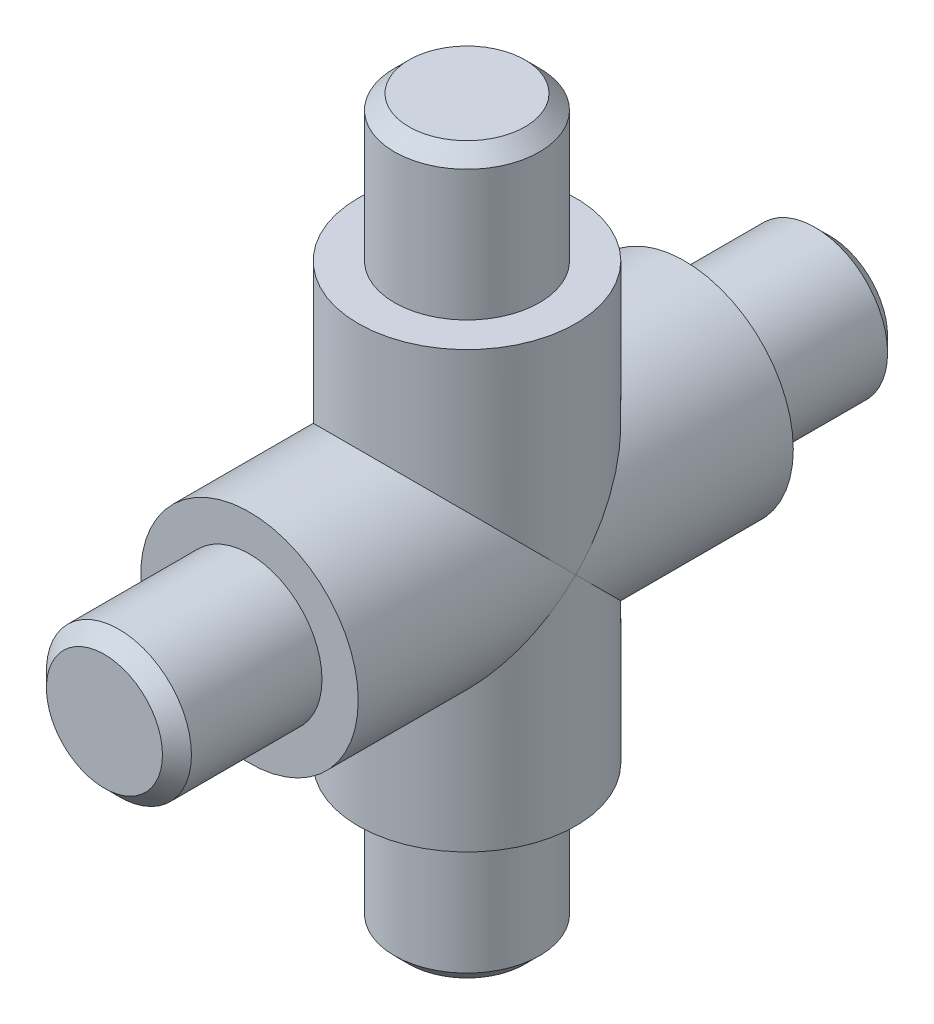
ISO-10303-21;
HEADER;
FILE_DESCRIPTION(('STEP AP214'),'2;1');
FILE_NAME('part.step','',(''),(''),'','','');
FILE_SCHEMA(('AUTOMOTIVE_DESIGN { 1 0 10303 214 1 1 1 1 }'));
ENDSEC;
DATA;
#1=APPLICATION_CONTEXT('core data for automotive mechanical design processes');
#2=APPLICATION_PROTOCOL_DEFINITION('international standard','automotive_design',2000,#1);
#3=PRODUCT_CONTEXT('',#1,'mechanical');
#4=PRODUCT('Part','Part','',(#3));
#5=PRODUCT_RELATED_PRODUCT_CATEGORY('part','',(#4));
#6=PRODUCT_DEFINITION_FORMATION('','',#4);
#7=PRODUCT_DEFINITION_CONTEXT('part definition',#1,'design');
#8=PRODUCT_DEFINITION('design','',#6,#7);
#9=PRODUCT_DEFINITION_SHAPE('','',#8);
#10=(LENGTH_UNIT() NAMED_UNIT(*) SI_UNIT(.MILLI.,.METRE.));
#11=(NAMED_UNIT(*) PLANE_ANGLE_UNIT() SI_UNIT($,.RADIAN.));
#12=(NAMED_UNIT(*) SI_UNIT($,.STERADIAN.) SOLID_ANGLE_UNIT());
#13=UNCERTAINTY_MEASURE_WITH_UNIT(LENGTH_MEASURE(1.E-05),#10,'distance_accuracy_value','');
#14=(GEOMETRIC_REPRESENTATION_CONTEXT(3) GLOBAL_UNCERTAINTY_ASSIGNED_CONTEXT((#13)) GLOBAL_UNIT_ASSIGNED_CONTEXT((#10,
#11,#12)) REPRESENTATION_CONTEXT('',''));
#15=CARTESIAN_POINT('',(0.,0.,0.));
#16=DIRECTION('',(0.,0.,1.));
#17=DIRECTION('',(1.,0.,0.));
#18=AXIS2_PLACEMENT_3D('',#15,#16,#17);
#19=CARTESIAN_POINT('',(0.,15.,25.));
#20=DIRECTION('',(0.,-1.,0.));
#21=DIRECTION('',(0.,0.,-1.));
#22=AXIS2_PLACEMENT_3D('',#19,#20,#21);
#23=CYLINDRICAL_SURFACE('',#22,7.5);
#24=CARTESIAN_POINT('',(0.,15.,25.));
#25=DIRECTION('',(0.,1.,0.));
#26=DIRECTION('',(0.,0.,1.));
#27=AXIS2_PLACEMENT_3D('',#24,#25,#26);
#28=CIRCLE('',#27,7.5);
#29=CARTESIAN_POINT('',(0.,15.,32.5));
#30=VERTEX_POINT('',#29);
#31=EDGE_CURVE('E129',#30,#30,#28,.T.);
#32=ORIENTED_EDGE('',*,*,#31,.F.);
#33=EDGE_LOOP('',(#32));
#34=FACE_BOUND('',#33,.T.);
#35=CARTESIAN_POINT('',(0.,0.,25.));
#36=DIRECTION('',(0.,-0.707106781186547,-0.707106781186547));
#37=DIRECTION('',(0.,-0.707106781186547,0.707106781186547));
#38=AXIS2_PLACEMENT_3D('',#35,#36,#37);
#39=ELLIPSE('',#38,10.6066017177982,7.5);
#40=CARTESIAN_POINT('',(-7.5,0.,25.));
#41=VERTEX_POINT('',#40);
#42=CARTESIAN_POINT('',(7.5,0.,25.));
#43=VERTEX_POINT('',#42);
#44=EDGE_CURVE('E47',#41,#43,#39,.T.);
#45=ORIENTED_EDGE('',*,*,#44,.F.);
#46=CARTESIAN_POINT('',(0.,0.,25.));
#47=DIRECTION('',(0.,-0.707106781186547,0.707106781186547));
#48=DIRECTION('',(0.,-0.707106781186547,-0.707106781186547));
#49=AXIS2_PLACEMENT_3D('',#46,#47,#48);
#50=ELLIPSE('',#49,10.6066017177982,7.5);
#51=EDGE_CURVE('E46',#43,#41,#50,.T.);
#52=ORIENTED_EDGE('',*,*,#51,.F.);
#53=EDGE_LOOP('',(#45,#52));
#54=FACE_BOUND('',#53,.T.);
#55=ADVANCED_FACE('F26',(#34,#54),#23,.T.);
#56=CARTESIAN_POINT('',(0.,15.,25.));
#57=DIRECTION('',(0.,1.,0.));
#58=DIRECTION('',(0.,0.,1.));
#59=AXIS2_PLACEMENT_3D('',#56,#57,#58);
#60=PLANE('',#59);
#61=ORIENTED_EDGE('',*,*,#31,.T.);
#62=EDGE_LOOP('',(#61));
#63=FACE_BOUND('',#62,.T.);
#64=CARTESIAN_POINT('',(0.,15.,25.));
#65=DIRECTION('',(0.,1.,0.));
#66=DIRECTION('',(0.,0.,1.));
#67=AXIS2_PLACEMENT_3D('',#64,#65,#66);
#68=CIRCLE('',#67,5.);
#69=CARTESIAN_POINT('',(0.,15.,30.));
#70=VERTEX_POINT('',#69);
#71=EDGE_CURVE('E132',#70,#70,#68,.T.);
#72=ORIENTED_EDGE('',*,*,#71,.F.);
#73=EDGE_LOOP('',(#72));
#74=FACE_BOUND('',#73,.T.);
#75=ADVANCED_FACE('F102',(#63,#74),#60,.T.);
#76=CARTESIAN_POINT('',(0.,25.,25.));
#77=DIRECTION('',(0.,1.,0.));
#78=DIRECTION('',(0.,0.,1.));
#79=AXIS2_PLACEMENT_3D('',#76,#77,#78);
#80=PLANE('',#79);
#81=CARTESIAN_POINT('',(0.,25.,25.));
#82=DIRECTION('',(0.,1.,0.));
#83=DIRECTION('',(0.,0.,1.));
#84=AXIS2_PLACEMENT_3D('',#81,#82,#83);
#85=CIRCLE('',#84,4.);
#86=CARTESIAN_POINT('',(0.,25.,29.));
#87=VERTEX_POINT('',#86);
#88=EDGE_CURVE('E59',#87,#87,#85,.T.);
#89=ORIENTED_EDGE('',*,*,#88,.T.);
#90=EDGE_LOOP('',(#89));
#91=FACE_BOUND('',#90,.T.);
#92=ADVANCED_FACE('F109',(#91),#80,.T.);
#93=CARTESIAN_POINT('',(0.,25.,25.));
#94=DIRECTION('',(0.,-1.,0.));
#95=DIRECTION('',(0.,0.,-1.));
#96=AXIS2_PLACEMENT_3D('',#93,#94,#95);
#97=CYLINDRICAL_SURFACE('',#96,5.);
#98=CARTESIAN_POINT('',(0.,24.,25.));
#99=DIRECTION('',(0.,1.,0.));
#100=DIRECTION('',(0.,0.,1.));
#101=AXIS2_PLACEMENT_3D('',#98,#99,#100);
#102=CIRCLE('',#101,5.);
#103=CARTESIAN_POINT('',(0.,24.,30.));
#104=VERTEX_POINT('',#103);
#105=EDGE_CURVE('E62',#104,#104,#102,.F.);
#106=ORIENTED_EDGE('',*,*,#105,.T.);
#107=EDGE_LOOP('',(#106));
#108=FACE_BOUND('',#107,.T.);
#109=ORIENTED_EDGE('',*,*,#71,.T.);
#110=EDGE_LOOP('',(#109));
#111=FACE_BOUND('',#110,.T.);
#112=ADVANCED_FACE('F182',(#108,#111),#97,.T.);
#113=CARTESIAN_POINT('',(0.,0.,10.));
#114=DIRECTION('',(0.,0.,1.));
#115=DIRECTION('',(1.,0.,0.));
#116=AXIS2_PLACEMENT_3D('',#113,#114,#115);
#117=PLANE('',#116);
#118=CARTESIAN_POINT('',(0.,0.,10.));
#119=DIRECTION('',(0.,0.,1.));
#120=DIRECTION('',(1.,0.,0.));
#121=AXIS2_PLACEMENT_3D('',#118,#119,#120);
#122=CIRCLE('',#121,7.5);
#123=CARTESIAN_POINT('',(7.5,0.,10.));
#124=VERTEX_POINT('',#123);
#125=EDGE_CURVE('E196',#124,#124,#122,.T.);
#126=ORIENTED_EDGE('',*,*,#125,.F.);
#127=EDGE_LOOP('',(#126));
#128=FACE_BOUND('',#127,.T.);
#129=CARTESIAN_POINT('',(0.,0.,10.));
#130=DIRECTION('',(0.,0.,1.));
#131=DIRECTION('',(1.,0.,0.));
#132=AXIS2_PLACEMENT_3D('',#129,#130,#131);
#133=CIRCLE('',#132,5.);
#134=CARTESIAN_POINT('',(5.,0.,10.));
#135=VERTEX_POINT('',#134);
#136=EDGE_CURVE('E54',#135,#135,#133,.T.);
#137=ORIENTED_EDGE('',*,*,#136,.T.);
#138=EDGE_LOOP('',(#137));
#139=FACE_BOUND('',#138,.T.);
#140=ADVANCED_FACE('F145',(#128,#139),#117,.F.);
#141=CARTESIAN_POINT('',(0.,0.,40.));
#142=DIRECTION('',(0.,0.,-1.));
#143=DIRECTION('',(-1.,0.,0.));
#144=AXIS2_PLACEMENT_3D('',#141,#142,#143);
#145=CYLINDRICAL_SURFACE('',#144,7.5);
#146=ORIENTED_EDGE('',*,*,#125,.T.);
#147=EDGE_LOOP('',(#146));
#148=FACE_BOUND('',#147,.T.);
#149=CARTESIAN_POINT('',(0.,0.,25.));
#150=DIRECTION('',(0.,-0.707106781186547,0.707106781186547));
#151=DIRECTION('',(0.,-0.707106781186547,-0.707106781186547));
#152=AXIS2_PLACEMENT_3D('',#149,#150,#151);
#153=ELLIPSE('',#152,10.6066017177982,7.5);
#154=EDGE_CURVE('E40',#43,#41,#153,.F.);
#155=ORIENTED_EDGE('',*,*,#154,.T.);
#156=ORIENTED_EDGE('',*,*,#44,.T.);
#157=EDGE_LOOP('',(#155,#156));
#158=FACE_BOUND('',#157,.T.);
#159=ADVANCED_FACE('F56',(#148,#158),#145,.T.);
#160=CARTESIAN_POINT('',(0.,0.,0.));
#161=DIRECTION('',(0.,0.,1.));
#162=DIRECTION('',(1.,0.,0.));
#163=AXIS2_PLACEMENT_3D('',#160,#161,#162);
#164=PLANE('',#163);
#165=CARTESIAN_POINT('',(0.,0.,0.));
#166=DIRECTION('',(0.,0.,1.));
#167=DIRECTION('',(1.,0.,0.));
#168=AXIS2_PLACEMENT_3D('',#165,#166,#167);
#169=CIRCLE('',#168,3.99999999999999);
#170=CARTESIAN_POINT('',(3.99999999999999,0.,0.));
#171=VERTEX_POINT('',#170);
#172=EDGE_CURVE('E81',#171,#171,#169,.F.);
#173=ORIENTED_EDGE('',*,*,#172,.T.);
#174=EDGE_LOOP('',(#173));
#175=FACE_BOUND('',#174,.T.);
#176=ADVANCED_FACE('F150',(#175),#164,.F.);
#177=CARTESIAN_POINT('',(0.,0.,50.));
#178=DIRECTION('',(0.,0.,-1.));
#179=DIRECTION('',(-1.,0.,0.));
#180=AXIS2_PLACEMENT_3D('',#177,#178,#179);
#181=CYLINDRICAL_SURFACE('',#180,5.);
#182=CARTESIAN_POINT('',(0.,0.,1.));
#183=DIRECTION('',(0.,0.,1.));
#184=DIRECTION('',(1.,0.,0.));
#185=AXIS2_PLACEMENT_3D('',#182,#183,#184);
#186=CIRCLE('',#185,5.);
#187=CARTESIAN_POINT('',(5.,0.,1.));
#188=VERTEX_POINT('',#187);
#189=EDGE_CURVE('E78',#188,#188,#186,.T.);
#190=ORIENTED_EDGE('',*,*,#189,.T.);
#191=EDGE_LOOP('',(#190));
#192=FACE_BOUND('',#191,.T.);
#193=ORIENTED_EDGE('',*,*,#136,.F.);
#194=EDGE_LOOP('',(#193));
#195=FACE_BOUND('',#194,.T.);
#196=ADVANCED_FACE('F147',(#192,#195),#181,.T.);
#197=CARTESIAN_POINT('',(0.,-25.,25.));
#198=DIRECTION('',(0.,1.,0.));
#199=DIRECTION('',(0.,0.,1.));
#200=AXIS2_PLACEMENT_3D('',#197,#198,#199);
#201=PLANE('',#200);
#202=CARTESIAN_POINT('',(0.,-25.,25.));
#203=DIRECTION('',(0.,1.,0.));
#204=DIRECTION('',(0.,0.,1.));
#205=AXIS2_PLACEMENT_3D('',#202,#203,#204);
#206=CIRCLE('',#205,4.);
#207=CARTESIAN_POINT('',(0.,-25.,29.));
#208=VERTEX_POINT('',#207);
#209=EDGE_CURVE('E11',#208,#208,#206,.F.);
#210=ORIENTED_EDGE('',*,*,#209,.T.);
#211=EDGE_LOOP('',(#210));
#212=FACE_BOUND('',#211,.T.);
#213=ADVANCED_FACE('F149',(#212),#201,.F.);
#214=CARTESIAN_POINT('',(0.,-24.,25.));
#215=DIRECTION('',(0.,1.,0.));
#216=DIRECTION('',(0.,0.,1.));
#217=AXIS2_PLACEMENT_3D('',#214,#215,#216);
#218=CIRCLE('',#217,5.);
#219=CARTESIAN_POINT('',(0.,-24.,30.));
#220=VERTEX_POINT('',#219);
#221=EDGE_CURVE('E34',#220,#220,#218,.T.);
#222=ORIENTED_EDGE('',*,*,#221,.T.);
#223=EDGE_LOOP('',(#222));
#224=FACE_BOUND('',#223,.T.);
#225=CARTESIAN_POINT('',(0.,-15.,25.));
#226=DIRECTION('',(0.,1.,0.));
#227=DIRECTION('',(0.,0.,1.));
#228=AXIS2_PLACEMENT_3D('',#225,#226,#227);
#229=CIRCLE('',#228,5.);
#230=CARTESIAN_POINT('',(0.,-15.,30.));
#231=VERTEX_POINT('',#230);
#232=EDGE_CURVE('E139',#231,#231,#229,.T.);
#233=ORIENTED_EDGE('',*,*,#232,.F.);
#234=EDGE_LOOP('',(#233));
#235=FACE_BOUND('',#234,.T.);
#236=ADVANCED_FACE('F86',(#224,#235),#97,.T.);
#237=CARTESIAN_POINT('',(0.,-15.,25.));
#238=DIRECTION('',(0.,1.,0.));
#239=DIRECTION('',(0.,0.,1.));
#240=AXIS2_PLACEMENT_3D('',#237,#238,#239);
#241=PLANE('',#240);
#242=CARTESIAN_POINT('',(0.,-15.,25.));
#243=DIRECTION('',(0.,1.,0.));
#244=DIRECTION('',(0.,0.,1.));
#245=AXIS2_PLACEMENT_3D('',#242,#243,#244);
#246=CIRCLE('',#245,7.5);
#247=CARTESIAN_POINT('',(0.,-15.,32.5));
#248=VERTEX_POINT('',#247);
#249=EDGE_CURVE('E67',#248,#248,#246,.T.);
#250=ORIENTED_EDGE('',*,*,#249,.F.);
#251=EDGE_LOOP('',(#250));
#252=FACE_BOUND('',#251,.T.);
#253=ORIENTED_EDGE('',*,*,#232,.T.);
#254=EDGE_LOOP('',(#253));
#255=FACE_BOUND('',#254,.T.);
#256=ADVANCED_FACE('F116',(#252,#255),#241,.F.);
#257=ORIENTED_EDGE('',*,*,#249,.T.);
#258=EDGE_LOOP('',(#257));
#259=FACE_BOUND('',#258,.T.);
#260=CARTESIAN_POINT('',(0.,0.,25.));
#261=DIRECTION('',(0.,-0.707106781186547,-0.707106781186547));
#262=DIRECTION('',(0.,-0.707106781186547,0.707106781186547));
#263=AXIS2_PLACEMENT_3D('',#260,#261,#262);
#264=ELLIPSE('',#263,10.6066017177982,7.5);
#265=EDGE_CURVE('E53',#41,#43,#264,.F.);
#266=ORIENTED_EDGE('',*,*,#265,.F.);
#267=ORIENTED_EDGE('',*,*,#154,.F.);
#268=EDGE_LOOP('',(#266,#267));
#269=FACE_BOUND('',#268,.T.);
#270=ADVANCED_FACE('F52',(#259,#269),#23,.T.);
#271=CARTESIAN_POINT('',(0.,0.,40.));
#272=DIRECTION('',(0.,0.,1.));
#273=DIRECTION('',(1.,0.,0.));
#274=AXIS2_PLACEMENT_3D('',#271,#272,#273);
#275=PLANE('',#274);
#276=CARTESIAN_POINT('',(0.,0.,40.));
#277=DIRECTION('',(0.,0.,1.));
#278=DIRECTION('',(1.,0.,0.));
#279=AXIS2_PLACEMENT_3D('',#276,#277,#278);
#280=CIRCLE('',#279,7.5);
#281=CARTESIAN_POINT('',(7.5,0.,40.));
#282=VERTEX_POINT('',#281);
#283=EDGE_CURVE('E68',#282,#282,#280,.T.);
#284=ORIENTED_EDGE('',*,*,#283,.T.);
#285=EDGE_LOOP('',(#284));
#286=FACE_BOUND('',#285,.T.);
#287=CARTESIAN_POINT('',(0.,0.,40.));
#288=DIRECTION('',(0.,0.,1.));
#289=DIRECTION('',(1.,0.,0.));
#290=AXIS2_PLACEMENT_3D('',#287,#288,#289);
#291=CIRCLE('',#290,5.);
#292=CARTESIAN_POINT('',(5.,0.,40.));
#293=VERTEX_POINT('',#292);
#294=EDGE_CURVE('E65',#293,#293,#291,.T.);
#295=ORIENTED_EDGE('',*,*,#294,.F.);
#296=EDGE_LOOP('',(#295));
#297=FACE_BOUND('',#296,.T.);
#298=ADVANCED_FACE('F115',(#286,#297),#275,.T.);
#299=ORIENTED_EDGE('',*,*,#283,.F.);
#300=EDGE_LOOP('',(#299));
#301=FACE_BOUND('',#300,.T.);
#302=ORIENTED_EDGE('',*,*,#51,.T.);
#303=ORIENTED_EDGE('',*,*,#265,.T.);
#304=EDGE_LOOP('',(#302,#303));
#305=FACE_BOUND('',#304,.T.);
#306=ADVANCED_FACE('F58',(#301,#305),#145,.T.);
#307=CARTESIAN_POINT('',(0.,0.,50.));
#308=DIRECTION('',(0.,0.,1.));
#309=DIRECTION('',(1.,0.,0.));
#310=AXIS2_PLACEMENT_3D('',#307,#308,#309);
#311=PLANE('',#310);
#312=CARTESIAN_POINT('',(0.,0.,50.));
#313=DIRECTION('',(0.,0.,1.));
#314=DIRECTION('',(1.,0.,0.));
#315=AXIS2_PLACEMENT_3D('',#312,#313,#314);
#316=CIRCLE('',#315,4.);
#317=CARTESIAN_POINT('',(4.,0.,50.));
#318=VERTEX_POINT('',#317);
#319=EDGE_CURVE('E72',#318,#318,#316,.T.);
#320=ORIENTED_EDGE('',*,*,#319,.T.);
#321=EDGE_LOOP('',(#320));
#322=FACE_BOUND('',#321,.T.);
#323=ADVANCED_FACE('F161',(#322),#311,.T.);
#324=CARTESIAN_POINT('',(0.,0.,49.));
#325=DIRECTION('',(0.,0.,1.));
#326=DIRECTION('',(1.,0.,0.));
#327=AXIS2_PLACEMENT_3D('',#324,#325,#326);
#328=CIRCLE('',#327,5.);
#329=CARTESIAN_POINT('',(5.,0.,49.));
#330=VERTEX_POINT('',#329);
#331=EDGE_CURVE('E75',#330,#330,#328,.F.);
#332=ORIENTED_EDGE('',*,*,#331,.T.);
#333=EDGE_LOOP('',(#332));
#334=FACE_BOUND('',#333,.T.);
#335=ORIENTED_EDGE('',*,*,#294,.T.);
#336=EDGE_LOOP('',(#335));
#337=FACE_BOUND('',#336,.T.);
#338=ADVANCED_FACE('F28',(#334,#337),#181,.T.);
#339=CARTESIAN_POINT('',(0.,25.,25.));
#340=DIRECTION('',(0.,-1.,0.));
#341=DIRECTION('',(0.,0.,-1.));
#342=AXIS2_PLACEMENT_3D('',#339,#340,#341);
#343=CONICAL_SURFACE('',#342,4.,0.785398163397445);
#344=ORIENTED_EDGE('',*,*,#105,.F.);
#345=EDGE_LOOP('',(#344));
#346=FACE_BOUND('',#345,.T.);
#347=ORIENTED_EDGE('',*,*,#88,.F.);
#348=EDGE_LOOP('',(#347));
#349=FACE_BOUND('',#348,.T.);
#350=ADVANCED_FACE('F160',(#346,#349),#343,.T.);
#351=CARTESIAN_POINT('',(0.,0.,50.));
#352=DIRECTION('',(0.,0.,-1.));
#353=DIRECTION('',(-1.,0.,0.));
#354=AXIS2_PLACEMENT_3D('',#351,#352,#353);
#355=CONICAL_SURFACE('',#354,4.,0.785398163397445);
#356=ORIENTED_EDGE('',*,*,#331,.F.);
#357=EDGE_LOOP('',(#356));
#358=FACE_BOUND('',#357,.T.);
#359=ORIENTED_EDGE('',*,*,#319,.F.);
#360=EDGE_LOOP('',(#359));
#361=FACE_BOUND('',#360,.T.);
#362=ADVANCED_FACE('F97',(#358,#361),#355,.T.);
#363=CARTESIAN_POINT('',(0.,0.,1.));
#364=DIRECTION('',(0.,0.,1.));
#365=DIRECTION('',(1.,0.,0.));
#366=AXIS2_PLACEMENT_3D('',#363,#364,#365);
#367=CONICAL_SURFACE('',#366,5.,0.785398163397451);
#368=ORIENTED_EDGE('',*,*,#172,.F.);
#369=EDGE_LOOP('',(#368));
#370=FACE_BOUND('',#369,.T.);
#371=ORIENTED_EDGE('',*,*,#189,.F.);
#372=EDGE_LOOP('',(#371));
#373=FACE_BOUND('',#372,.T.);
#374=ADVANCED_FACE('F91',(#370,#373),#367,.T.);
#375=CARTESIAN_POINT('',(0.,-24.,25.));
#376=DIRECTION('',(0.,1.,0.));
#377=DIRECTION('',(0.,0.,1.));
#378=AXIS2_PLACEMENT_3D('',#375,#376,#377);
#379=CONICAL_SURFACE('',#378,5.,0.78539816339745);
#380=ORIENTED_EDGE('',*,*,#209,.F.);
#381=EDGE_LOOP('',(#380));
#382=FACE_BOUND('',#381,.T.);
#383=ORIENTED_EDGE('',*,*,#221,.F.);
#384=EDGE_LOOP('',(#383));
#385=FACE_BOUND('',#384,.T.);
#386=ADVANCED_FACE('F89',(#382,#385),#379,.T.);
#387=CLOSED_SHELL('',(#55,#75,#92,#112,#140,#159,#176,#196,#213,#236,#256,#270,#298,#306,#323,
#338,#350,#362,#374,#386));
#388=MANIFOLD_SOLID_BREP('B2',#387);
#389=ADVANCED_BREP_SHAPE_REPRESENTATION('',(#18,#388),#14);
#390=SHAPE_DEFINITION_REPRESENTATION(#9,#389);
ENDSEC;
END-ISO-10303-21;
